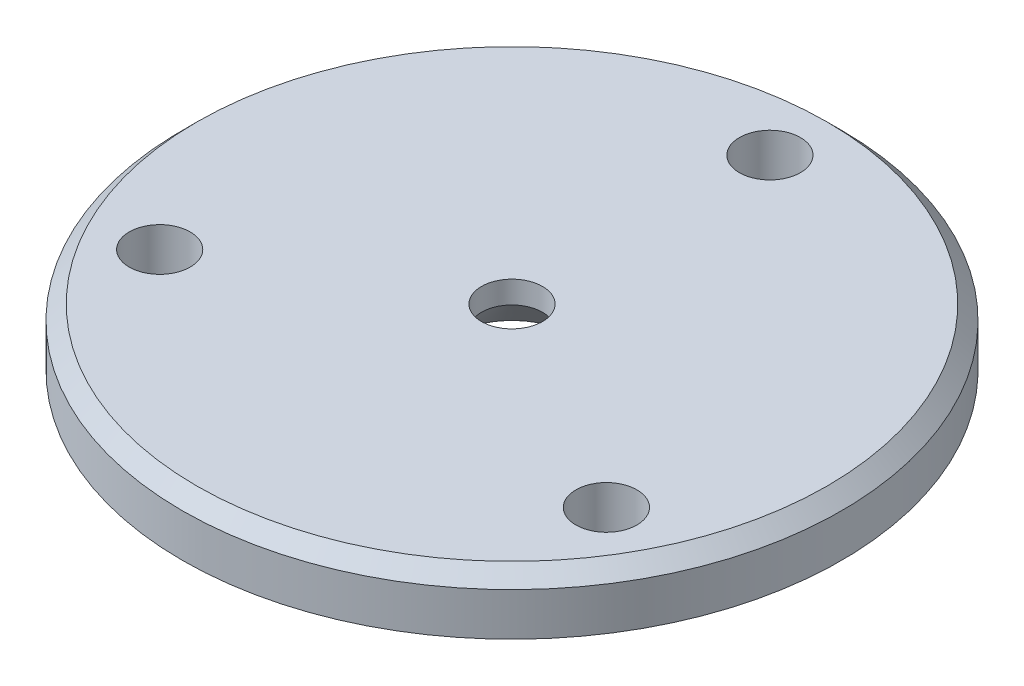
ISO-10303-21;
HEADER;
FILE_DESCRIPTION(('STEP AP214'),'2;1');
FILE_NAME('part.step','',(''),(''),'','','');
FILE_SCHEMA(('AUTOMOTIVE_DESIGN { 1 0 10303 214 1 1 1 1 }'));
ENDSEC;
DATA;
#1=APPLICATION_CONTEXT('core data for automotive mechanical design processes');
#2=APPLICATION_PROTOCOL_DEFINITION('international standard','automotive_design',2000,#1);
#3=PRODUCT_CONTEXT('',#1,'mechanical');
#4=PRODUCT('Part','Part','',(#3));
#5=PRODUCT_RELATED_PRODUCT_CATEGORY('part','',(#4));
#6=PRODUCT_DEFINITION_FORMATION('','',#4);
#7=PRODUCT_DEFINITION_CONTEXT('part definition',#1,'design');
#8=PRODUCT_DEFINITION('design','',#6,#7);
#9=PRODUCT_DEFINITION_SHAPE('','',#8);
#10=(LENGTH_UNIT() NAMED_UNIT(*) SI_UNIT(.MILLI.,.METRE.));
#11=(NAMED_UNIT(*) PLANE_ANGLE_UNIT() SI_UNIT($,.RADIAN.));
#12=(NAMED_UNIT(*) SI_UNIT($,.STERADIAN.) SOLID_ANGLE_UNIT());
#13=UNCERTAINTY_MEASURE_WITH_UNIT(LENGTH_MEASURE(1.E-05),#10,'distance_accuracy_value','');
#14=(GEOMETRIC_REPRESENTATION_CONTEXT(3) GLOBAL_UNCERTAINTY_ASSIGNED_CONTEXT((#13)) GLOBAL_UNIT_ASSIGNED_CONTEXT((#10,
#11,#12)) REPRESENTATION_CONTEXT('',''));
#15=CARTESIAN_POINT('',(0.,0.,0.));
#16=DIRECTION('',(0.,0.,1.));
#17=DIRECTION('',(1.,0.,0.));
#18=AXIS2_PLACEMENT_3D('',#15,#16,#17);
#19=CARTESIAN_POINT('',(0.,3.175,0.));
#20=DIRECTION('',(0.,-1.,0.));
#21=DIRECTION('',(0.,0.,-1.));
#22=AXIS2_PLACEMENT_3D('',#19,#20,#21);
#23=CYLINDRICAL_SURFACE('',#22,36.5125);
#24=CARTESIAN_POINT('',(0.,1.5875,0.));
#25=DIRECTION('',(0.,1.,0.));
#26=DIRECTION('',(0.,0.,1.));
#27=AXIS2_PLACEMENT_3D('',#24,#25,#26);
#28=CIRCLE('',#27,36.5125);
#29=CARTESIAN_POINT('',(0.,1.5875,36.5125));
#30=VERTEX_POINT('',#29);
#31=EDGE_CURVE('E9',#30,#30,#28,.F.);
#32=ORIENTED_EDGE('',*,*,#31,.T.);
#33=EDGE_LOOP('',(#32));
#34=FACE_BOUND('',#33,.T.);
#35=CARTESIAN_POINT('',(0.,-3.175,0.));
#36=DIRECTION('',(0.,1.,0.));
#37=DIRECTION('',(0.,0.,1.));
#38=AXIS2_PLACEMENT_3D('',#35,#36,#37);
#39=CIRCLE('',#38,36.5125);
#40=CARTESIAN_POINT('',(0.,-3.175,36.5125));
#41=VERTEX_POINT('',#40);
#42=EDGE_CURVE('E24',#41,#41,#39,.T.);
#43=ORIENTED_EDGE('',*,*,#42,.T.);
#44=EDGE_LOOP('',(#43));
#45=FACE_BOUND('',#44,.T.);
#46=ADVANCED_FACE('F13',(#34,#45),#23,.T.);
#47=CARTESIAN_POINT('',(0.,3.175,0.));
#48=DIRECTION('',(0.,1.,0.));
#49=DIRECTION('',(0.,0.,1.));
#50=AXIS2_PLACEMENT_3D('',#47,#48,#49);
#51=PLANE('',#50);
#52=CARTESIAN_POINT('',(0.,3.175,0.));
#53=DIRECTION('',(0.,1.,0.));
#54=DIRECTION('',(0.,0.,1.));
#55=AXIS2_PLACEMENT_3D('',#52,#53,#54);
#56=CIRCLE('',#55,34.925);
#57=CARTESIAN_POINT('',(0.,3.175,34.925));
#58=VERTEX_POINT('',#57);
#59=EDGE_CURVE('E20',#58,#58,#56,.T.);
#60=ORIENTED_EDGE('',*,*,#59,.T.);
#61=EDGE_LOOP('',(#60));
#62=FACE_BOUND('',#61,.T.);
#63=CARTESIAN_POINT('',(0.,3.175,0.));
#64=DIRECTION('',(0.,-1.,0.));
#65=DIRECTION('',(0.,0.,-1.));
#66=AXIS2_PLACEMENT_3D('',#63,#64,#65);
#67=CIRCLE('',#66,3.3782);
#68=CARTESIAN_POINT('',(0.,3.175,-3.3782));
#69=VERTEX_POINT('',#68);
#70=EDGE_CURVE('E48',#69,#69,#67,.T.);
#71=ORIENTED_EDGE('',*,*,#70,.T.);
#72=EDGE_LOOP('',(#71));
#73=FACE_BOUND('',#72,.T.);
#74=CARTESIAN_POINT('',(0.,3.175,-28.575));
#75=DIRECTION('',(0.,1.,0.));
#76=DIRECTION('',(0.,0.,1.));
#77=AXIS2_PLACEMENT_3D('',#74,#75,#76);
#78=CIRCLE('',#77,3.3782);
#79=CARTESIAN_POINT('',(0.,3.175,-25.1968));
#80=VERTEX_POINT('',#79);
#81=EDGE_CURVE('E45',#80,#80,#78,.T.);
#82=ORIENTED_EDGE('',*,*,#81,.F.);
#83=EDGE_LOOP('',(#82));
#84=FACE_BOUND('',#83,.T.);
#85=CARTESIAN_POINT('',(-24.7466759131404,3.175,14.2874999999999));
#86=DIRECTION('',(0.,1.,0.));
#87=DIRECTION('',(0.,0.,1.));
#88=AXIS2_PLACEMENT_3D('',#85,#86,#87);
#89=CIRCLE('',#88,3.3782);
#90=CARTESIAN_POINT('',(-24.7466759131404,3.175,17.6656999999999));
#91=VERTEX_POINT('',#90);
#92=EDGE_CURVE('E34',#91,#91,#89,.T.);
#93=ORIENTED_EDGE('',*,*,#92,.F.);
#94=EDGE_LOOP('',(#93));
#95=FACE_BOUND('',#94,.T.);
#96=CARTESIAN_POINT('',(24.7466759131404,3.175,14.2874999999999));
#97=DIRECTION('',(0.,1.,0.));
#98=DIRECTION('',(0.,0.,1.));
#99=AXIS2_PLACEMENT_3D('',#96,#97,#98);
#100=CIRCLE('',#99,3.3782);
#101=CARTESIAN_POINT('',(24.7466759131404,3.175,17.6656999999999));
#102=VERTEX_POINT('',#101);
#103=EDGE_CURVE('E33',#102,#102,#100,.T.);
#104=ORIENTED_EDGE('',*,*,#103,.F.);
#105=EDGE_LOOP('',(#104));
#106=FACE_BOUND('',#105,.T.);
#107=ADVANCED_FACE('F64',(#62,#73,#84,#95,#106),#51,.T.);
#108=CARTESIAN_POINT('',(0.,-3.175,0.));
#109=DIRECTION('',(0.,1.,0.));
#110=DIRECTION('',(0.,0.,1.));
#111=AXIS2_PLACEMENT_3D('',#108,#109,#110);
#112=PLANE('',#111);
#113=CARTESIAN_POINT('',(0.,-3.175,0.));
#114=DIRECTION('',(0.,-1.,0.));
#115=DIRECTION('',(0.,0.,-1.));
#116=AXIS2_PLACEMENT_3D('',#113,#114,#115);
#117=CIRCLE('',#116,6.7437);
#118=CARTESIAN_POINT('',(0.,-3.175,-6.7437));
#119=VERTEX_POINT('',#118);
#120=EDGE_CURVE('E54',#119,#119,#117,.T.);
#121=ORIENTED_EDGE('',*,*,#120,.F.);
#122=EDGE_LOOP('',(#121));
#123=FACE_BOUND('',#122,.T.);
#124=CARTESIAN_POINT('',(0.,-3.175,-28.575));
#125=DIRECTION('',(0.,1.,0.));
#126=DIRECTION('',(0.,0.,1.));
#127=AXIS2_PLACEMENT_3D('',#124,#125,#126);
#128=CIRCLE('',#127,3.3782);
#129=CARTESIAN_POINT('',(0.,-3.175,-25.1968));
#130=VERTEX_POINT('',#129);
#131=EDGE_CURVE('E42',#130,#130,#128,.T.);
#132=ORIENTED_EDGE('',*,*,#131,.T.);
#133=EDGE_LOOP('',(#132));
#134=FACE_BOUND('',#133,.T.);
#135=CARTESIAN_POINT('',(-24.7466759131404,-3.175,14.2874999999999));
#136=DIRECTION('',(0.,1.,0.));
#137=DIRECTION('',(0.,0.,1.));
#138=AXIS2_PLACEMENT_3D('',#135,#136,#137);
#139=CIRCLE('',#138,3.3782);
#140=CARTESIAN_POINT('',(-24.7466759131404,-3.175,17.6656999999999));
#141=VERTEX_POINT('',#140);
#142=EDGE_CURVE('E31',#141,#141,#139,.T.);
#143=ORIENTED_EDGE('',*,*,#142,.T.);
#144=EDGE_LOOP('',(#143));
#145=FACE_BOUND('',#144,.T.);
#146=CARTESIAN_POINT('',(24.7466759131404,-3.175,14.2874999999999));
#147=DIRECTION('',(0.,1.,0.));
#148=DIRECTION('',(0.,0.,1.));
#149=AXIS2_PLACEMENT_3D('',#146,#147,#148);
#150=CIRCLE('',#149,3.3782);
#151=CARTESIAN_POINT('',(24.7466759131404,-3.175,17.6656999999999));
#152=VERTEX_POINT('',#151);
#153=EDGE_CURVE('E28',#152,#152,#150,.T.);
#154=ORIENTED_EDGE('',*,*,#153,.T.);
#155=EDGE_LOOP('',(#154));
#156=FACE_BOUND('',#155,.T.);
#157=ORIENTED_EDGE('',*,*,#42,.F.);
#158=EDGE_LOOP('',(#157));
#159=FACE_BOUND('',#158,.T.);
#160=ADVANCED_FACE('F60',(#123,#134,#145,#156,#159),#112,.F.);
#161=CARTESIAN_POINT('',(24.7466759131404,3.175,14.2874999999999));
#162=DIRECTION('',(0.,1.,0.));
#163=DIRECTION('',(0.,0.,1.));
#164=AXIS2_PLACEMENT_3D('',#161,#162,#163);
#165=CYLINDRICAL_SURFACE('',#164,3.3782);
#166=ORIENTED_EDGE('',*,*,#103,.T.);
#167=EDGE_LOOP('',(#166));
#168=FACE_BOUND('',#167,.T.);
#169=ORIENTED_EDGE('',*,*,#153,.F.);
#170=EDGE_LOOP('',(#169));
#171=FACE_BOUND('',#170,.T.);
#172=ADVANCED_FACE('F63',(#168,#171),#165,.F.);
#173=CARTESIAN_POINT('',(-24.7466759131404,3.175,14.2874999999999));
#174=DIRECTION('',(0.,1.,0.));
#175=DIRECTION('',(0.,0.,1.));
#176=AXIS2_PLACEMENT_3D('',#173,#174,#175);
#177=CYLINDRICAL_SURFACE('',#176,3.3782);
#178=ORIENTED_EDGE('',*,*,#92,.T.);
#179=EDGE_LOOP('',(#178));
#180=FACE_BOUND('',#179,.T.);
#181=ORIENTED_EDGE('',*,*,#142,.F.);
#182=EDGE_LOOP('',(#181));
#183=FACE_BOUND('',#182,.T.);
#184=ADVANCED_FACE('F83',(#180,#183),#177,.F.);
#185=CARTESIAN_POINT('',(0.,3.175,-28.575));
#186=DIRECTION('',(0.,1.,0.));
#187=DIRECTION('',(0.,0.,1.));
#188=AXIS2_PLACEMENT_3D('',#185,#186,#187);
#189=CYLINDRICAL_SURFACE('',#188,3.3782);
#190=ORIENTED_EDGE('',*,*,#81,.T.);
#191=EDGE_LOOP('',(#190));
#192=FACE_BOUND('',#191,.T.);
#193=ORIENTED_EDGE('',*,*,#131,.F.);
#194=EDGE_LOOP('',(#193));
#195=FACE_BOUND('',#194,.T.);
#196=ADVANCED_FACE('F87',(#192,#195),#189,.F.);
#197=CARTESIAN_POINT('',(0.,-3.175,0.));
#198=DIRECTION('',(0.,-1.,0.));
#199=DIRECTION('',(0.,0.,-1.));
#200=AXIS2_PLACEMENT_3D('',#197,#198,#199);
#201=CYLINDRICAL_SURFACE('',#200,3.3782);
#202=ORIENTED_EDGE('',*,*,#70,.F.);
#203=EDGE_LOOP('',(#202));
#204=FACE_BOUND('',#203,.T.);
#205=CARTESIAN_POINT('',(0.,0.696564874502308,0.));
#206=DIRECTION('',(0.,-1.,0.));
#207=DIRECTION('',(0.,0.,-1.));
#208=AXIS2_PLACEMENT_3D('',#205,#206,#207);
#209=CIRCLE('',#208,3.3782);
#210=CARTESIAN_POINT('',(0.,0.696564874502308,-3.3782));
#211=VERTEX_POINT('',#210);
#212=EDGE_CURVE('E51',#211,#211,#209,.T.);
#213=ORIENTED_EDGE('',*,*,#212,.T.);
#214=EDGE_LOOP('',(#213));
#215=FACE_BOUND('',#214,.T.);
#216=ADVANCED_FACE('F91',(#204,#215),#201,.F.);
#217=CARTESIAN_POINT('',(0.,-3.175,0.));
#218=DIRECTION('',(0.,-1.,0.));
#219=DIRECTION('',(0.,0.,-1.));
#220=AXIS2_PLACEMENT_3D('',#217,#218,#219);
#221=CONICAL_SURFACE('',#220,6.7437,0.715584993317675);
#222=ORIENTED_EDGE('',*,*,#212,.F.);
#223=EDGE_LOOP('',(#222));
#224=FACE_BOUND('',#223,.T.);
#225=ORIENTED_EDGE('',*,*,#120,.T.);
#226=EDGE_LOOP('',(#225));
#227=FACE_BOUND('',#226,.T.);
#228=ADVANCED_FACE('F58',(#224,#227),#221,.F.);
#229=CARTESIAN_POINT('',(0.,3.175,0.));
#230=DIRECTION('',(0.,-1.,0.));
#231=DIRECTION('',(0.,0.,-1.));
#232=AXIS2_PLACEMENT_3D('',#229,#230,#231);
#233=CONICAL_SURFACE('',#232,34.925,0.785398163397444);
#234=ORIENTED_EDGE('',*,*,#31,.F.);
#235=EDGE_LOOP('',(#234));
#236=FACE_BOUND('',#235,.T.);
#237=ORIENTED_EDGE('',*,*,#59,.F.);
#238=EDGE_LOOP('',(#237));
#239=FACE_BOUND('',#238,.T.);
#240=ADVANCED_FACE('F15',(#236,#239),#233,.T.);
#241=CLOSED_SHELL('',(#46,#107,#160,#172,#184,#196,#216,#228,#240));
#242=MANIFOLD_SOLID_BREP('B1',#241);
#243=ADVANCED_BREP_SHAPE_REPRESENTATION('',(#18,#242),#14);
#244=SHAPE_DEFINITION_REPRESENTATION(#9,#243);
ENDSEC;
END-ISO-10303-21;
